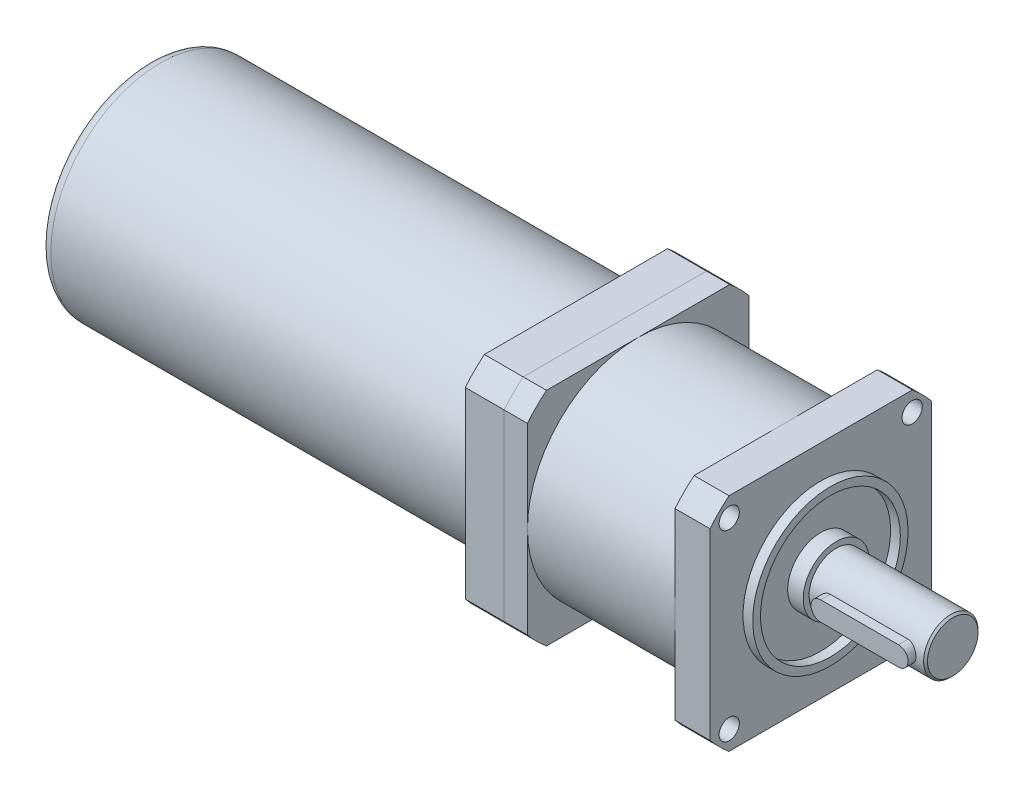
from build123d import *

# Parameters (mm, degrees)
EXTRUDE_1_DEPTH     = 9
SKETCH_2_R          = 28.5
EXTRUDE_2_DEPTH     = 38
EXTRUDE_3_DEPTH     = 6
SKETCH_6_R          = 2.6
CUT_EXTRUDE_2_DEPTH = 9
SKETCH_7_R          = 20
SKETCH_7_R_2        = 18
EXTRUDE_5_DEPTH     = 2.5
SKETCH_8_R          = 8.5
EXTRUDE_6_DEPTH     = 4
SKETCH_9_R          = 7
EXTRUDE_7_DEPTH     = 30
CUT_EXTRUDE_3_DEPTH = 3
EXTRUDE_START       = 5
EXTRUDE_8_DEPTH     = 5
CHAMFER_1_SIZE      = 0.5
EXTRUDE_9_DEPTH     = 10
SKETCH_15_R         = 28.2
EXTRUDE_10_DEPTH    = 110
FILLET_1_R          = 3


with BuildPart() as part:
    # Sketch 1 → Extrude 1 (new body)
    with BuildSketch(Plane(origin=(0, 0, 0), x_dir=(0, 0, -1), z_dir=(1, 0, 0))):
        with BuildLine():
            Line((-23.595550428, -28.5), (23.595550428, -28.5))
            ThreePointArc((23.595550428, -28.5), (26.162950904, -26.162950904), (28.5, -23.595550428))
            Line((28.5, -23.595550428), (28.5, 23.595550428))
            ThreePointArc((28.5, 23.595550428), (26.162950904, 26.162950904), (23.595550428, 28.5))
            Line((23.595550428, 28.5), (-23.595550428, 28.5))
            ThreePointArc((-23.595550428, 28.5), (-26.162950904, 26.162950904), (-28.5, 23.595550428))
            Line((-28.5, 23.595550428), (-28.5, -23.595550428))
            ThreePointArc((-28.5, -23.595550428), (-26.162950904, -26.162950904), (-23.595550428, -28.5))
        make_face()
    extrude(amount=-EXTRUDE_1_DEPTH)

    # Sketch 2 → Extrude 2 (add)
    with BuildSketch(Plane.ZY.offset(9)):
        Circle(SKETCH_2_R)
    extrude(amount=EXTRUDE_2_DEPTH)

    # Sketch 3 → Extrude 3 (add)
    with BuildSketch(Plane.ZY.offset(47)):
        with BuildLine():
            Line((-23.595550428, -28.5), (23.595550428, -28.5))
            ThreePointArc((23.595550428, -28.5), (26.162950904, -26.162950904), (28.5, -23.595550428))
            Line((28.5, -23.595550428), (28.5, 23.595550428))
            ThreePointArc((28.5, 23.595550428), (26.162950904, 26.162950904), (23.595550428, 28.5))
            Line((23.595550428, 28.5), (-23.595550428, 28.5))
            ThreePointArc((-23.595550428, 28.5), (-26.162950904, 26.162950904), (-28.5, 23.595550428))
            Line((-28.5, 23.595550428), (-28.5, -23.595550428))
            ThreePointArc((-28.5, -23.595550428), (-26.162950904, -26.162950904), (-23.595550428, -28.5))
        make_face()
    extrude(amount=EXTRUDE_3_DEPTH)

    # Sketch 6 → Cut-Extrude 2 (cut)
    with BuildSketch(Plane(origin=(0, 0, 0), x_dir=(0, 0, -1), z_dir=(1, 0, 0))):
        with Locations((-23.55, 23.55)):
            Circle(SKETCH_6_R)
        with Locations((23.55, 23.55)):
            Circle(SKETCH_6_R)
        with Locations((23.55, -23.55)):
            Circle(SKETCH_6_R)
        with Locations((-23.55, -23.55)):
            Circle(SKETCH_6_R)
    extrude(amount=-CUT_EXTRUDE_2_DEPTH, mode=Mode.SUBTRACT)

    # Sketch 7 → Extrude 5 (add)
    with BuildSketch(Plane(origin=(0, 0, 0), x_dir=(0, 0, -1), z_dir=(1, 0, 0))):
        Circle(SKETCH_7_R)
        Circle(SKETCH_7_R_2, mode=Mode.SUBTRACT)
    extrude(amount=EXTRUDE_5_DEPTH)

    # Sketch 8 → Extrude 6 (add)
    with BuildSketch(Plane(origin=(0, 0, 0), x_dir=(0, 0, -1), z_dir=(1, 0, 0))):
        Circle(SKETCH_8_R)
    extrude(amount=EXTRUDE_6_DEPTH)

    # Sketch 9 → Extrude 7 (add)
    with BuildSketch(Plane(origin=(4, 0, 0), x_dir=(0, 0, -1), z_dir=(1, 0, 0))):
        Circle(SKETCH_9_R)
    extrude(amount=EXTRUDE_7_DEPTH)

    # Sketch 10 → Cut-Extrude 3 (cut)
    with BuildSketch(Plane.XY.offset(7)):
        with BuildLine():
            Line((9, 2.5), (29, 2.5))
            ThreePointArc((29, 2.5), (31.5, 0), (29, -2.5))
            Line((29, -2.5), (9, -2.5))
            ThreePointArc((9, -2.5), (6.5, 0), (9, 2.5))
        make_face()
    extrude(amount=-CUT_EXTRUDE_3_DEPTH, mode=Mode.SUBTRACT)

    # Sketch 11 → Extrude 8 (add)
    with BuildSketch(Plane.XY.offset(4).offset(EXTRUDE_START)):
        with BuildLine():
            Line((9, 2.5), (29, 2.5))
            ThreePointArc((29, 2.5), (31.5, 0), (29, -2.5))
            Line((29, -2.5), (9, -2.5))
            ThreePointArc((9, -2.5), (6.5, 0), (9, 2.5))
        make_face()
    extrude(amount=-EXTRUDE_8_DEPTH)

    # Chamfer 1
    chamfer_1_edges = [part.edges().sort_by_distance(p)[0] for p in [
        (34, 0, 7),
    ]]
    chamfer(chamfer_1_edges, length=CHAMFER_1_SIZE)


with BuildPart() as body_2:
    # Sketch 14 → Extrude 9 (new body)
    with BuildSketch(Plane.ZY.offset(53)):
        with BuildLine():
            Line((-23.595550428, -28.5), (23.595550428, -28.5))
            ThreePointArc((23.595550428, -28.5), (26.162950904, -26.162950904), (28.5, -23.595550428))
            Line((28.5, -23.595550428), (28.5, 23.595550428))
            ThreePointArc((28.5, 23.595550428), (26.162950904, 26.162950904), (23.595550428, 28.5))
            Line((23.595550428, 28.5), (-23.595550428, 28.5))
            ThreePointArc((-23.595550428, 28.5), (-26.162950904, 26.162950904), (-28.5, 23.595550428))
            Line((-28.5, 23.595550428), (-28.5, -23.595550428))
            ThreePointArc((-28.5, -23.595550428), (-26.162950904, -26.162950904), (-23.595550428, -28.5))
        make_face()
    extrude(amount=EXTRUDE_9_DEPTH)

    # Sketch 15 → Extrude 10 (add)
    with BuildSketch(Plane.ZY.offset(63)):
        Circle(SKETCH_15_R)
    extrude(amount=EXTRUDE_10_DEPTH)

    # Fillet 1
    fillet_1_edges = [body_2.edges().sort_by_distance(p)[0] for p in [
        (-173, 0, -28.2),
    ]]
    fillet(fillet_1_edges, radius=FILLET_1_R)


solid = Compound([part.part, body_2.part])
